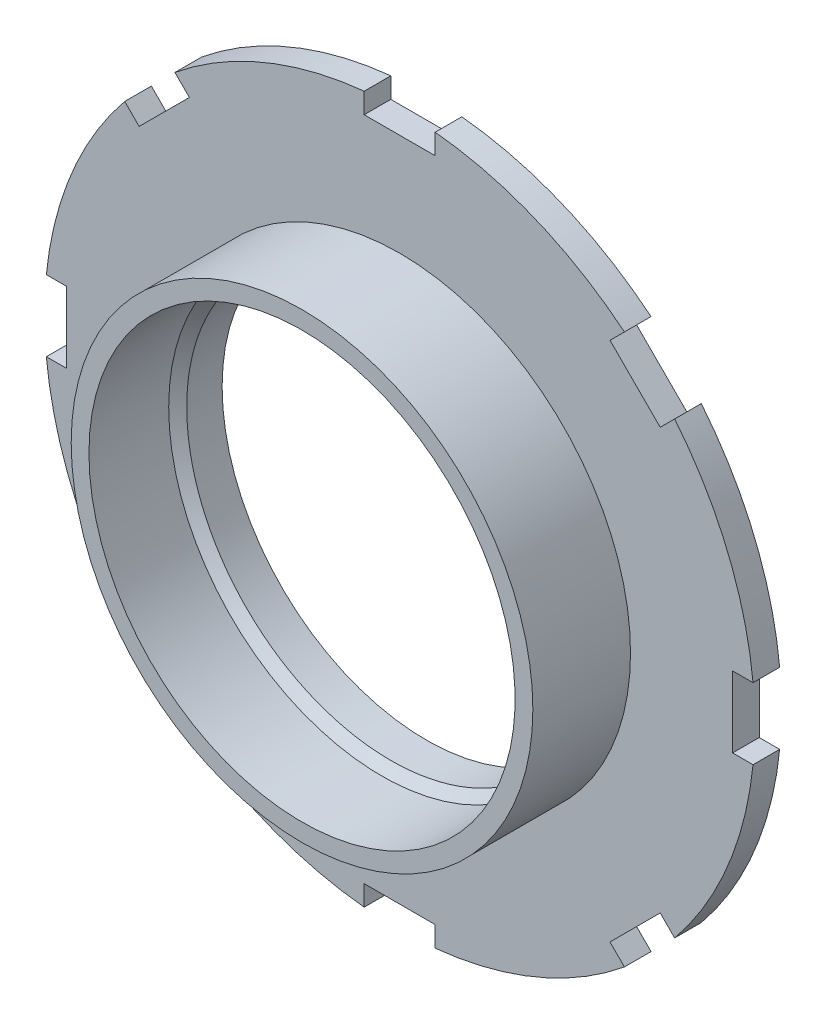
from build123d import *

# Parameters (mm, degrees)
ESQUISSE1_R                  = 40
EXTRUSION1_DEPTH             = 3
ESQUISSE2_R                  = 26
EXTRUSION2_DEPTH             = 11
ESQUISSE3_R                  = 24
ENL_V_MAT_EXTRU_1_DEPTH      = 59.275209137
ENL_V_MAT_EXTRU_2_DEPTH      = 59.275209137
R_P_TITION_CIRCULAIRE1_COUNT = 8
ESQUISSE5_R                  = 24
ESQUISSE5_R_2                = 23
EXTRUSION3_DEPTH             = 4


with BuildPart() as part:
    # Esquisse1 → Extrusion1 (new body)
    with BuildSketch(Plane.XY):
        Circle(ESQUISSE1_R)
    extrude(amount=EXTRUSION1_DEPTH)

    # Esquisse2 → Extrusion2 (add)
    with BuildSketch(Plane.XY.offset(3)):
        Circle(ESQUISSE2_R)
    extrude(amount=EXTRUSION2_DEPTH)

    # Esquisse3 → Enl_v. mat.-Extru.1 (cut, through all)
    with BuildSketch(Plane(origin=(0, 0, 0), x_dir=(-1, 0, 0), z_dir=(0, 0, -1))):
        Circle(ESQUISSE3_R)
    extrude(amount=-ENL_V_MAT_EXTRU_1_DEPTH, mode=Mode.SUBTRACT)

    # Esquisse4 → Enl_v. mat.-Extru.2 (cut, symmetric)
    with BuildSketch(Plane(origin=(0, 0, 0), x_dir=(-1, 0, 0), z_dir=(0, 0, -1))):
        Polygon((-4, 232.051628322), (-4, 39.799497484), (-4, 37.5), (4, 37.5), (4, 39.799497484), (4, 232.051628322), (4, 616.555889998), (-4, 616.555889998), align=None)
    enl_v_mat_extru_2 = extrude(amount=ENL_V_MAT_EXTRU_2_DEPTH, both=True, mode=Mode.SUBTRACT)

    # R_p_tition circulaire1: Enl_v. mat.-Extru.2 ×8 about axis
    r_p_tition_circulaire1_axis = Axis((0, 0, 0), (0, 0, -1))
    for i in range(1, R_P_TITION_CIRCULAIRE1_COUNT):
        add(enl_v_mat_extru_2.rotate(r_p_tition_circulaire1_axis, i * 360 / R_P_TITION_CIRCULAIRE1_COUNT), mode=Mode.SUBTRACT)

    # Esquisse5 → Extrusion3 (add)
    with BuildSketch(Plane(origin=(0, 0, 0), x_dir=(-1, 0, 0), z_dir=(0, 0, -1))):
        Circle(ESQUISSE5_R)
        Circle(ESQUISSE5_R_2, mode=Mode.SUBTRACT)
    extrude(amount=-EXTRUSION3_DEPTH)

    # Esquisse7 → R_volution1 (revolve)
    with BuildSketch(Plane(origin=(0, 0, 0), x_dir=(0, 0, -1), z_dir=(1, 0, 0)), mode=Mode.PRIVATE) as r_volution1_sk:
        Polygon((-4, 22.983333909), (-5.016666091, 24), (-4, 24), align=None)
    revolve(r_volution1_sk.sketch.rotate(Axis((0, 0, 5.016666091), (0, 0, 1)), 90), axis=Axis((0, 0, 5.016666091), (0, 0, 1)))


solid = part.part
